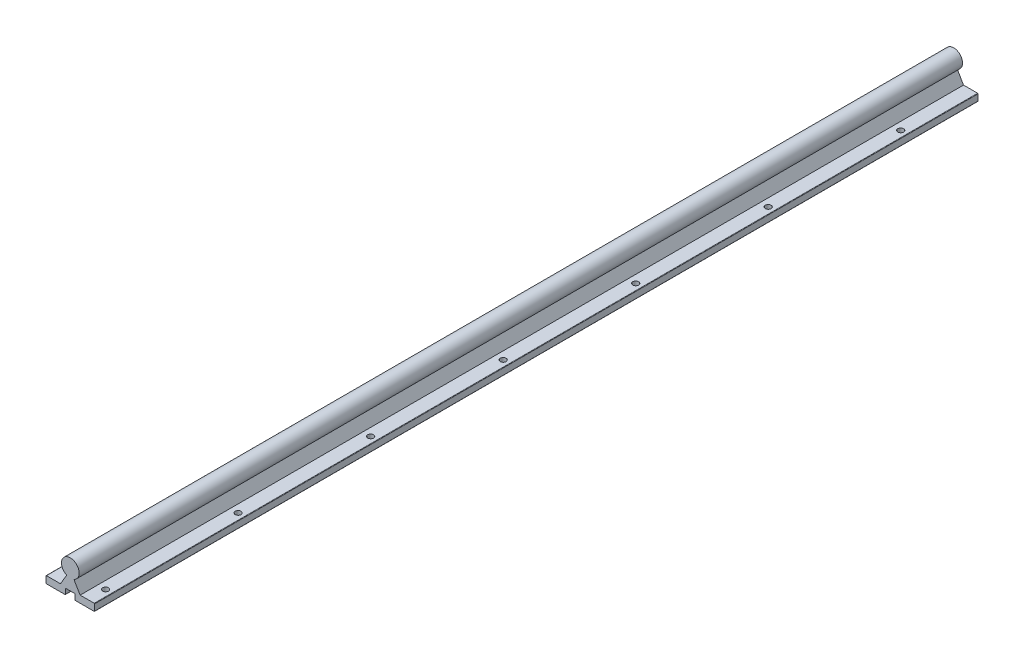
ISO-10303-21;
HEADER;
FILE_DESCRIPTION(('STEP AP214'),'2;1');
FILE_NAME('part.step','',(''),(''),'','','');
FILE_SCHEMA(('AUTOMOTIVE_DESIGN { 1 0 10303 214 1 1 1 1 }'));
ENDSEC;
DATA;
#1=APPLICATION_CONTEXT('core data for automotive mechanical design processes');
#2=APPLICATION_PROTOCOL_DEFINITION('international standard','automotive_design',2000,#1);
#3=PRODUCT_CONTEXT('',#1,'mechanical');
#4=PRODUCT('Part','Part','',(#3));
#5=PRODUCT_RELATED_PRODUCT_CATEGORY('part','',(#4));
#6=PRODUCT_DEFINITION_FORMATION('','',#4);
#7=PRODUCT_DEFINITION_CONTEXT('part definition',#1,'design');
#8=PRODUCT_DEFINITION('design','',#6,#7);
#9=PRODUCT_DEFINITION_SHAPE('','',#8);
#10=(LENGTH_UNIT() NAMED_UNIT(*) SI_UNIT(.MILLI.,.METRE.));
#11=(NAMED_UNIT(*) PLANE_ANGLE_UNIT() SI_UNIT($,.RADIAN.));
#12=(NAMED_UNIT(*) SI_UNIT($,.STERADIAN.) SOLID_ANGLE_UNIT());
#13=UNCERTAINTY_MEASURE_WITH_UNIT(LENGTH_MEASURE(1.E-05),#10,'distance_accuracy_value','');
#14=(GEOMETRIC_REPRESENTATION_CONTEXT(3) GLOBAL_UNCERTAINTY_ASSIGNED_CONTEXT((#13)) GLOBAL_UNIT_ASSIGNED_CONTEXT((#10,
#11,#12)) REPRESENTATION_CONTEXT('',''));
#15=CARTESIAN_POINT('',(0.,0.,0.));
#16=DIRECTION('',(0.,0.,1.));
#17=DIRECTION('',(1.,0.,0.));
#18=AXIS2_PLACEMENT_3D('',#15,#16,#17);
#19=CARTESIAN_POINT('',(-27.,4.,1000.));
#20=DIRECTION('',(0.,-1.,0.));
#21=DIRECTION('',(0.,0.,-1.));
#22=AXIS2_PLACEMENT_3D('',#19,#20,#21);
#23=PLANE('',#22);
#24=CARTESIAN_POINT('',(-20.,4.,80.000000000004));
#25=DIRECTION('',(0.,1.,0.));
#26=DIRECTION('',(0.,0.,1.));
#27=AXIS2_PLACEMENT_3D('',#24,#25,#26);
#28=CIRCLE('',#27,3.3);
#29=CARTESIAN_POINT('',(-20.,4.,83.3000000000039));
#30=VERTEX_POINT('',#29);
#31=EDGE_CURVE('E1045',#30,#30,#28,.T.);
#32=ORIENTED_EDGE('',*,*,#31,.F.);
#33=EDGE_LOOP('',(#32));
#34=FACE_BOUND('',#33,.T.);
#35=CARTESIAN_POINT('',(-20.,4.,380.000000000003));
#36=DIRECTION('',(0.,1.,0.));
#37=DIRECTION('',(0.,0.,1.));
#38=AXIS2_PLACEMENT_3D('',#35,#36,#37);
#39=CIRCLE('',#38,3.3);
#40=CARTESIAN_POINT('',(-20.,4.,383.300000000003));
#41=VERTEX_POINT('',#40);
#42=EDGE_CURVE('E1059',#41,#41,#39,.T.);
#43=ORIENTED_EDGE('',*,*,#42,.F.);
#44=EDGE_LOOP('',(#43));
#45=FACE_BOUND('',#44,.T.);
#46=CARTESIAN_POINT('',(-20.,4.,530.000000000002));
#47=DIRECTION('',(0.,1.,0.));
#48=DIRECTION('',(0.,0.,1.));
#49=AXIS2_PLACEMENT_3D('',#46,#47,#48);
#50=CIRCLE('',#49,3.3);
#51=CARTESIAN_POINT('',(-20.,4.,533.300000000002));
#52=VERTEX_POINT('',#51);
#53=EDGE_CURVE('E1067',#52,#52,#50,.T.);
#54=ORIENTED_EDGE('',*,*,#53,.F.);
#55=EDGE_LOOP('',(#54));
#56=FACE_BOUND('',#55,.T.);
#57=CARTESIAN_POINT('',(-20.,4.,680.000000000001));
#58=DIRECTION('',(0.,1.,0.));
#59=DIRECTION('',(0.,0.,1.));
#60=AXIS2_PLACEMENT_3D('',#57,#58,#59);
#61=CIRCLE('',#60,3.3);
#62=CARTESIAN_POINT('',(-20.,4.,683.300000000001));
#63=VERTEX_POINT('',#62);
#64=EDGE_CURVE('E1075',#63,#63,#61,.T.);
#65=ORIENTED_EDGE('',*,*,#64,.F.);
#66=EDGE_LOOP('',(#65));
#67=FACE_BOUND('',#66,.T.);
#68=CARTESIAN_POINT('',(-20.,4.,830.000000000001));
#69=DIRECTION('',(0.,1.,0.));
#70=DIRECTION('',(0.,0.,1.));
#71=AXIS2_PLACEMENT_3D('',#68,#69,#70);
#72=CIRCLE('',#71,3.3);
#73=CARTESIAN_POINT('',(-20.,4.,833.300000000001));
#74=VERTEX_POINT('',#73);
#75=EDGE_CURVE('E1083',#74,#74,#72,.T.);
#76=ORIENTED_EDGE('',*,*,#75,.F.);
#77=EDGE_LOOP('',(#76));
#78=FACE_BOUND('',#77,.T.);
#79=CARTESIAN_POINT('',(-20.,4.,980.));
#80=DIRECTION('',(0.,1.,0.));
#81=DIRECTION('',(0.,0.,1.));
#82=AXIS2_PLACEMENT_3D('',#79,#80,#81);
#83=CIRCLE('',#82,3.3);
#84=CARTESIAN_POINT('',(-20.,4.,983.3));
#85=VERTEX_POINT('',#84);
#86=EDGE_CURVE('E1139',#85,#85,#83,.T.);
#87=ORIENTED_EDGE('',*,*,#86,.F.);
#88=EDGE_LOOP('',(#87));
#89=FACE_BOUND('',#88,.T.);
#90=DIRECTION('',(-1.,0.,0.));
#91=VECTOR('',#90,1.);
#92=CARTESIAN_POINT('',(-27.,4.,0.));
#93=LINE('',#92,#91);
#94=CARTESIAN_POINT('',(-11.151813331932,4.,0.));
#95=VERTEX_POINT('',#94);
#96=CARTESIAN_POINT('',(-27.,4.,0.));
#97=VERTEX_POINT('',#96);
#98=EDGE_CURVE('E280',#95,#97,#93,.T.);
#99=ORIENTED_EDGE('',*,*,#98,.T.);
#100=DIRECTION('',(0.,0.,-1.));
#101=VECTOR('',#100,1.);
#102=CARTESIAN_POINT('',(-27.,4.,1000.));
#103=LINE('',#102,#101);
#104=CARTESIAN_POINT('',(-27.,4.,1000.));
#105=VERTEX_POINT('',#104);
#106=EDGE_CURVE('E390',#105,#97,#103,.T.);
#107=ORIENTED_EDGE('',*,*,#106,.F.);
#108=DIRECTION('',(-1.,0.,0.));
#109=VECTOR('',#108,1.);
#110=CARTESIAN_POINT('',(-27.,4.,1000.));
#111=LINE('',#110,#109);
#112=CARTESIAN_POINT('',(-11.151813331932,4.,1000.));
#113=VERTEX_POINT('',#112);
#114=EDGE_CURVE('E439',#113,#105,#111,.T.);
#115=ORIENTED_EDGE('',*,*,#114,.F.);
#116=DIRECTION('',(0.,0.,-1.));
#117=VECTOR('',#116,1.);
#118=CARTESIAN_POINT('',(-11.151813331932,4.,1000.));
#119=LINE('',#118,#117);
#120=EDGE_CURVE('E394',#113,#95,#119,.T.);
#121=ORIENTED_EDGE('',*,*,#120,.T.);
#122=EDGE_LOOP('',(#99,#107,#115,#121));
#123=FACE_BOUND('',#122,.T.);
#124=CARTESIAN_POINT('',(-20.,4.,230.000000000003));
#125=DIRECTION('',(0.,1.,0.));
#126=DIRECTION('',(0.,0.,1.));
#127=AXIS2_PLACEMENT_3D('',#124,#125,#126);
#128=CIRCLE('',#127,3.3);
#129=CARTESIAN_POINT('',(-20.,4.,233.300000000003));
#130=VERTEX_POINT('',#129);
#131=EDGE_CURVE('E1049',#130,#130,#128,.T.);
#132=ORIENTED_EDGE('',*,*,#131,.F.);
#133=EDGE_LOOP('',(#132));
#134=FACE_BOUND('',#133,.T.);
#135=ADVANCED_FACE('F61',(#34,#45,#56,#67,#78,#89,#123,#134),#23,.F.);
#136=CARTESIAN_POINT('',(11.151813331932,4.,1000.));
#137=DIRECTION('',(0.,-1.,0.));
#138=DIRECTION('',(0.,0.,-1.));
#139=AXIS2_PLACEMENT_3D('',#136,#137,#138);
#140=PLANE('',#139);
#141=CARTESIAN_POINT('',(20.,4.,80.000000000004));
#142=DIRECTION('',(0.,1.,0.));
#143=DIRECTION('',(0.,0.,1.));
#144=AXIS2_PLACEMENT_3D('',#141,#142,#143);
#145=CIRCLE('',#144,3.3);
#146=CARTESIAN_POINT('',(20.,4.,83.3000000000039));
#147=VERTEX_POINT('',#146);
#148=EDGE_CURVE('E1091',#147,#147,#145,.T.);
#149=ORIENTED_EDGE('',*,*,#148,.F.);
#150=EDGE_LOOP('',(#149));
#151=FACE_BOUND('',#150,.T.);
#152=CARTESIAN_POINT('',(20.,4.,230.000000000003));
#153=DIRECTION('',(0.,1.,0.));
#154=DIRECTION('',(0.,0.,1.));
#155=AXIS2_PLACEMENT_3D('',#152,#153,#154);
#156=CIRCLE('',#155,3.3);
#157=CARTESIAN_POINT('',(20.,4.,233.300000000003));
#158=VERTEX_POINT('',#157);
#159=EDGE_CURVE('E1099',#158,#158,#156,.T.);
#160=ORIENTED_EDGE('',*,*,#159,.F.);
#161=EDGE_LOOP('',(#160));
#162=FACE_BOUND('',#161,.T.);
#163=CARTESIAN_POINT('',(20.,4.,380.000000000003));
#164=DIRECTION('',(0.,1.,0.));
#165=DIRECTION('',(0.,0.,1.));
#166=AXIS2_PLACEMENT_3D('',#163,#164,#165);
#167=CIRCLE('',#166,3.3);
#168=CARTESIAN_POINT('',(20.,4.,383.300000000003));
#169=VERTEX_POINT('',#168);
#170=EDGE_CURVE('E1107',#169,#169,#167,.T.);
#171=ORIENTED_EDGE('',*,*,#170,.F.);
#172=EDGE_LOOP('',(#171));
#173=FACE_BOUND('',#172,.T.);
#174=CARTESIAN_POINT('',(20.,4.,680.000000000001));
#175=DIRECTION('',(0.,1.,0.));
#176=DIRECTION('',(0.,0.,1.));
#177=AXIS2_PLACEMENT_3D('',#174,#175,#176);
#178=CIRCLE('',#177,3.3);
#179=CARTESIAN_POINT('',(20.,4.,683.300000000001));
#180=VERTEX_POINT('',#179);
#181=EDGE_CURVE('E1123',#180,#180,#178,.T.);
#182=ORIENTED_EDGE('',*,*,#181,.F.);
#183=EDGE_LOOP('',(#182));
#184=FACE_BOUND('',#183,.T.);
#185=CARTESIAN_POINT('',(20.,4.,830.000000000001));
#186=DIRECTION('',(0.,1.,0.));
#187=DIRECTION('',(0.,0.,1.));
#188=AXIS2_PLACEMENT_3D('',#185,#186,#187);
#189=CIRCLE('',#188,3.3);
#190=CARTESIAN_POINT('',(20.,4.,833.300000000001));
#191=VERTEX_POINT('',#190);
#192=EDGE_CURVE('E1131',#191,#191,#189,.T.);
#193=ORIENTED_EDGE('',*,*,#192,.F.);
#194=EDGE_LOOP('',(#193));
#195=FACE_BOUND('',#194,.T.);
#196=CARTESIAN_POINT('',(20.,4.,980.));
#197=DIRECTION('',(0.,1.,0.));
#198=DIRECTION('',(0.,0.,1.));
#199=AXIS2_PLACEMENT_3D('',#196,#197,#198);
#200=CIRCLE('',#199,3.3);
#201=CARTESIAN_POINT('',(20.,4.,983.3));
#202=VERTEX_POINT('',#201);
#203=EDGE_CURVE('E1147',#202,#202,#200,.T.);
#204=ORIENTED_EDGE('',*,*,#203,.F.);
#205=EDGE_LOOP('',(#204));
#206=FACE_BOUND('',#205,.T.);
#207=DIRECTION('',(-1.,0.,0.));
#208=VECTOR('',#207,1.);
#209=CARTESIAN_POINT('',(11.151813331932,4.,0.));
#210=LINE('',#209,#208);
#211=CARTESIAN_POINT('',(27.,4.,0.));
#212=VERTEX_POINT('',#211);
#213=CARTESIAN_POINT('',(11.151813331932,4.,0.));
#214=VERTEX_POINT('',#213);
#215=EDGE_CURVE('E156',#212,#214,#210,.T.);
#216=ORIENTED_EDGE('',*,*,#215,.T.);
#217=DIRECTION('',(0.,0.,-1.));
#218=VECTOR('',#217,1.);
#219=CARTESIAN_POINT('',(11.151813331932,4.,1000.));
#220=LINE('',#219,#218);
#221=CARTESIAN_POINT('',(11.151813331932,4.,1000.));
#222=VERTEX_POINT('',#221);
#223=EDGE_CURVE('E249',#222,#214,#220,.T.);
#224=ORIENTED_EDGE('',*,*,#223,.F.);
#225=DIRECTION('',(-1.,0.,0.));
#226=VECTOR('',#225,1.);
#227=CARTESIAN_POINT('',(11.151813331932,4.,1000.));
#228=LINE('',#227,#226);
#229=CARTESIAN_POINT('',(27.,4.,1000.));
#230=VERTEX_POINT('',#229);
#231=EDGE_CURVE('E235',#230,#222,#228,.T.);
#232=ORIENTED_EDGE('',*,*,#231,.F.);
#233=DIRECTION('',(0.,0.,-1.));
#234=VECTOR('',#233,1.);
#235=CARTESIAN_POINT('',(27.,4.,1000.));
#236=LINE('',#235,#234);
#237=EDGE_CURVE('E243',#230,#212,#236,.T.);
#238=ORIENTED_EDGE('',*,*,#237,.T.);
#239=EDGE_LOOP('',(#216,#224,#232,#238));
#240=FACE_BOUND('',#239,.T.);
#241=CARTESIAN_POINT('',(20.,4.,530.000000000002));
#242=DIRECTION('',(0.,1.,0.));
#243=DIRECTION('',(0.,0.,1.));
#244=AXIS2_PLACEMENT_3D('',#241,#242,#243);
#245=CIRCLE('',#244,3.3);
#246=CARTESIAN_POINT('',(20.,4.,533.300000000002));
#247=VERTEX_POINT('',#246);
#248=EDGE_CURVE('E1115',#247,#247,#245,.T.);
#249=ORIENTED_EDGE('',*,*,#248,.F.);
#250=EDGE_LOOP('',(#249));
#251=FACE_BOUND('',#250,.T.);
#252=ADVANCED_FACE('F251',(#151,#162,#173,#184,#195,#206,#240,#251),#140,.F.);
#253=CARTESIAN_POINT('',(3.96518292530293,15.14,1000.));
#254=DIRECTION('',(0.,0.,-1.));
#255=DIRECTION('',(-1.,0.,0.));
#256=AXIS2_PLACEMENT_3D('',#253,#254,#255);
#257=CYLINDRICAL_SURFACE('',#256,0.5);
#258=CARTESIAN_POINT('',(3.96518292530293,15.14,0.));
#259=DIRECTION('',(0.,0.,1.));
#260=DIRECTION('',(1.,0.,0.));
#261=AXIS2_PLACEMENT_3D('',#258,#259,#260);
#262=CIRCLE('',#261,0.5);
#263=CARTESIAN_POINT('',(4.39526328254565,15.3950115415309,0.));
#264=VERTEX_POINT('',#263);
#265=CARTESIAN_POINT('',(3.96518292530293,15.64,0.));
#266=VERTEX_POINT('',#265);
#267=EDGE_CURVE('E260',#264,#266,#262,.T.);
#268=ORIENTED_EDGE('',*,*,#267,.T.);
#269=DIRECTION('',(0.,0.,-1.));
#270=VECTOR('',#269,1.);
#271=CARTESIAN_POINT('',(3.96518292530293,15.64,1000.));
#272=LINE('',#271,#270);
#273=CARTESIAN_POINT('',(3.96518292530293,15.64,1000.));
#274=VERTEX_POINT('',#273);
#275=EDGE_CURVE('E12',#274,#266,#272,.T.);
#276=ORIENTED_EDGE('',*,*,#275,.F.);
#277=CARTESIAN_POINT('',(3.96518292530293,15.14,1000.));
#278=DIRECTION('',(0.,0.,1.));
#279=DIRECTION('',(1.,0.,0.));
#280=AXIS2_PLACEMENT_3D('',#277,#278,#279);
#281=CIRCLE('',#280,0.5);
#282=CARTESIAN_POINT('',(4.39526328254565,15.3950115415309,1000.));
#283=VERTEX_POINT('',#282);
#284=EDGE_CURVE('E331',#283,#274,#281,.T.);
#285=ORIENTED_EDGE('',*,*,#284,.F.);
#286=DIRECTION('',(0.,0.,-1.));
#287=VECTOR('',#286,1.);
#288=CARTESIAN_POINT('',(4.39526328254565,15.3950115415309,1000.));
#289=LINE('',#288,#287);
#290=EDGE_CURVE('E256',#283,#264,#289,.T.);
#291=ORIENTED_EDGE('',*,*,#290,.T.);
#292=EDGE_LOOP('',(#268,#276,#285,#291));
#293=FACE_BOUND('',#292,.T.);
#294=ADVANCED_FACE('F63',(#293),#257,.T.);
#295=CARTESIAN_POINT('',(3.52000000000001,15.64,1000.));
#296=DIRECTION('',(0.,-1.,0.));
#297=DIRECTION('',(0.,0.,-1.));
#298=AXIS2_PLACEMENT_3D('',#295,#296,#297);
#299=PLANE('',#298);
#300=DIRECTION('',(-1.,0.,0.));
#301=VECTOR('',#300,1.);
#302=CARTESIAN_POINT('',(3.52000000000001,15.64,0.));
#303=LINE('',#302,#301);
#304=CARTESIAN_POINT('',(3.52,15.64,0.));
#305=VERTEX_POINT('',#304);
#306=EDGE_CURVE('E264',#266,#305,#303,.T.);
#307=ORIENTED_EDGE('',*,*,#306,.T.);
#308=DIRECTION('',(0.,0.,-1.));
#309=VECTOR('',#308,1.);
#310=CARTESIAN_POINT('',(3.52,15.64,1000.));
#311=LINE('',#310,#309);
#312=CARTESIAN_POINT('',(3.52,15.64,1000.));
#313=VERTEX_POINT('',#312);
#314=EDGE_CURVE('E71',#313,#305,#311,.T.);
#315=ORIENTED_EDGE('',*,*,#314,.F.);
#316=DIRECTION('',(-1.,0.,0.));
#317=VECTOR('',#316,1.);
#318=CARTESIAN_POINT('',(3.52000000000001,15.64,1000.));
#319=LINE('',#318,#317);
#320=EDGE_CURVE('E170',#274,#313,#319,.T.);
#321=ORIENTED_EDGE('',*,*,#320,.F.);
#322=ORIENTED_EDGE('',*,*,#275,.T.);
#323=EDGE_LOOP('',(#307,#315,#321,#322));
#324=FACE_BOUND('',#323,.T.);
#325=ADVANCED_FACE('F531',(#324),#299,.F.);
#326=CARTESIAN_POINT('',(0.,25.,1000.));
#327=DIRECTION('',(0.,0.,-1.));
#328=DIRECTION('',(-1.,0.,0.));
#329=AXIS2_PLACEMENT_3D('',#326,#327,#328);
#330=CYLINDRICAL_SURFACE('',#329,10.);
#331=CARTESIAN_POINT('',(0.,25.,0.));
#332=DIRECTION('',(0.,0.,1.));
#333=DIRECTION('',(1.,0.,0.));
#334=AXIS2_PLACEMENT_3D('',#331,#332,#333);
#335=CIRCLE('',#334,10.);
#336=CARTESIAN_POINT('',(-3.52000000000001,15.64,0.));
#337=VERTEX_POINT('',#336);
#338=EDGE_CURVE('E268',#305,#337,#335,.T.);
#339=ORIENTED_EDGE('',*,*,#338,.T.);
#340=DIRECTION('',(0.,0.,-1.));
#341=VECTOR('',#340,1.);
#342=CARTESIAN_POINT('',(-3.52000000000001,15.64,1000.));
#343=LINE('',#342,#341);
#344=CARTESIAN_POINT('',(-3.52000000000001,15.64,1000.));
#345=VERTEX_POINT('',#344);
#346=EDGE_CURVE('E406',#345,#337,#343,.T.);
#347=ORIENTED_EDGE('',*,*,#346,.F.);
#348=CARTESIAN_POINT('',(0.,25.,1000.));
#349=DIRECTION('',(0.,0.,1.));
#350=DIRECTION('',(1.,0.,0.));
#351=AXIS2_PLACEMENT_3D('',#348,#349,#350);
#352=CIRCLE('',#351,10.);
#353=EDGE_CURVE('E416',#313,#345,#352,.T.);
#354=ORIENTED_EDGE('',*,*,#353,.F.);
#355=ORIENTED_EDGE('',*,*,#314,.T.);
#356=EDGE_LOOP('',(#339,#347,#354,#355));
#357=FACE_BOUND('',#356,.T.);
#358=ADVANCED_FACE('F414',(#357),#330,.T.);
#359=CARTESIAN_POINT('',(-3.96518292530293,15.64,1000.));
#360=DIRECTION('',(0.,-1.,0.));
#361=DIRECTION('',(0.,0.,-1.));
#362=AXIS2_PLACEMENT_3D('',#359,#360,#361);
#363=PLANE('',#362);
#364=DIRECTION('',(-1.,0.,0.));
#365=VECTOR('',#364,1.);
#366=CARTESIAN_POINT('',(-3.96518292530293,15.64,0.));
#367=LINE('',#366,#365);
#368=CARTESIAN_POINT('',(-3.96518292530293,15.64,0.));
#369=VERTEX_POINT('',#368);
#370=EDGE_CURVE('E271',#337,#369,#367,.T.);
#371=ORIENTED_EDGE('',*,*,#370,.T.);
#372=DIRECTION('',(0.,0.,-1.));
#373=VECTOR('',#372,1.);
#374=CARTESIAN_POINT('',(-3.96518292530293,15.64,1000.));
#375=LINE('',#374,#373);
#376=CARTESIAN_POINT('',(-3.96518292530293,15.64,1000.));
#377=VERTEX_POINT('',#376);
#378=EDGE_CURVE('E402',#377,#369,#375,.T.);
#379=ORIENTED_EDGE('',*,*,#378,.F.);
#380=DIRECTION('',(-1.,0.,0.));
#381=VECTOR('',#380,1.);
#382=CARTESIAN_POINT('',(-3.96518292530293,15.64,1000.));
#383=LINE('',#382,#381);
#384=EDGE_CURVE('E435',#345,#377,#383,.T.);
#385=ORIENTED_EDGE('',*,*,#384,.F.);
#386=ORIENTED_EDGE('',*,*,#346,.T.);
#387=EDGE_LOOP('',(#371,#379,#385,#386));
#388=FACE_BOUND('',#387,.T.);
#389=ADVANCED_FACE('F425',(#388),#363,.F.);
#390=CARTESIAN_POINT('',(-3.96518292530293,15.14,1000.));
#391=DIRECTION('',(0.,0.,-1.));
#392=DIRECTION('',(-1.,0.,0.));
#393=AXIS2_PLACEMENT_3D('',#390,#391,#392);
#394=CYLINDRICAL_SURFACE('',#393,0.5);
#395=CARTESIAN_POINT('',(-3.96518292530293,15.14,0.));
#396=DIRECTION('',(0.,0.,1.));
#397=DIRECTION('',(-1.,0.,0.));
#398=AXIS2_PLACEMENT_3D('',#395,#396,#397);
#399=CIRCLE('',#398,0.5);
#400=CARTESIAN_POINT('',(-4.39526328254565,15.3950115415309,0.));
#401=VERTEX_POINT('',#400);
#402=EDGE_CURVE('E274',#369,#401,#399,.T.);
#403=ORIENTED_EDGE('',*,*,#402,.T.);
#404=DIRECTION('',(0.,0.,-1.));
#405=VECTOR('',#404,1.);
#406=CARTESIAN_POINT('',(-4.39526328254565,15.3950115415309,1000.));
#407=LINE('',#406,#405);
#408=CARTESIAN_POINT('',(-4.39526328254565,15.3950115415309,1000.));
#409=VERTEX_POINT('',#408);
#410=EDGE_CURVE('E398',#409,#401,#407,.T.);
#411=ORIENTED_EDGE('',*,*,#410,.F.);
#412=CARTESIAN_POINT('',(-3.96518292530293,15.14,1000.));
#413=DIRECTION('',(0.,0.,1.));
#414=DIRECTION('',(-1.,0.,0.));
#415=AXIS2_PLACEMENT_3D('',#412,#413,#414);
#416=CIRCLE('',#415,0.5);
#417=EDGE_CURVE('E431',#377,#409,#416,.T.);
#418=ORIENTED_EDGE('',*,*,#417,.F.);
#419=ORIENTED_EDGE('',*,*,#378,.T.);
#420=EDGE_LOOP('',(#403,#411,#418,#419));
#421=FACE_BOUND('',#420,.T.);
#422=ADVANCED_FACE('F429',(#421),#394,.T.);
#423=CARTESIAN_POINT('',(-11.151813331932,4.,1000.));
#424=DIRECTION('',(0.86016071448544,-0.510023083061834,0.));
#425=DIRECTION('',(0.510023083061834,0.86016071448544,0.));
#426=AXIS2_PLACEMENT_3D('',#423,#424,#425);
#427=PLANE('',#426);
#428=DIRECTION('',(-0.510023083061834,-0.86016071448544,0.));
#429=VECTOR('',#428,1.);
#430=CARTESIAN_POINT('',(-11.151813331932,4.,0.));
#431=LINE('',#430,#429);
#432=EDGE_CURVE('E277',#401,#95,#431,.T.);
#433=ORIENTED_EDGE('',*,*,#432,.T.);
#434=ORIENTED_EDGE('',*,*,#120,.F.);
#435=DIRECTION('',(-0.510023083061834,-0.86016071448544,0.));
#436=VECTOR('',#435,1.);
#437=CARTESIAN_POINT('',(-11.151813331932,4.,1000.));
#438=LINE('',#437,#436);
#439=EDGE_CURVE('E434',#409,#113,#438,.T.);
#440=ORIENTED_EDGE('',*,*,#439,.F.);
#441=ORIENTED_EDGE('',*,*,#410,.T.);
#442=EDGE_LOOP('',(#433,#434,#440,#441));
#443=FACE_BOUND('',#442,.T.);
#444=ADVANCED_FACE('F522',(#443),#427,.F.);
#445=CARTESIAN_POINT('',(-27.,3.5,1000.));
#446=DIRECTION('',(0.,0.,-1.));
#447=DIRECTION('',(-1.,0.,0.));
#448=AXIS2_PLACEMENT_3D('',#445,#446,#447);
#449=CYLINDRICAL_SURFACE('',#448,0.5);
#450=CARTESIAN_POINT('',(-27.,3.5,0.));
#451=DIRECTION('',(0.,0.,1.));
#452=DIRECTION('',(1.,0.,0.));
#453=AXIS2_PLACEMENT_3D('',#450,#451,#452);
#454=CIRCLE('',#453,0.5);
#455=CARTESIAN_POINT('',(-27.5,3.5,0.));
#456=VERTEX_POINT('',#455);
#457=EDGE_CURVE('E283',#97,#456,#454,.T.);
#458=ORIENTED_EDGE('',*,*,#457,.T.);
#459=DIRECTION('',(0.,0.,-1.));
#460=VECTOR('',#459,1.);
#461=CARTESIAN_POINT('',(-27.5,3.5,1000.));
#462=LINE('',#461,#460);
#463=CARTESIAN_POINT('',(-27.5,3.5,1000.));
#464=VERTEX_POINT('',#463);
#465=EDGE_CURVE('E386',#464,#456,#462,.T.);
#466=ORIENTED_EDGE('',*,*,#465,.F.);
#467=CARTESIAN_POINT('',(-27.,3.5,1000.));
#468=DIRECTION('',(0.,0.,1.));
#469=DIRECTION('',(1.,0.,0.));
#470=AXIS2_PLACEMENT_3D('',#467,#468,#469);
#471=CIRCLE('',#470,0.5);
#472=EDGE_CURVE('E446',#105,#464,#471,.T.);
#473=ORIENTED_EDGE('',*,*,#472,.F.);
#474=ORIENTED_EDGE('',*,*,#106,.T.);
#475=EDGE_LOOP('',(#458,#466,#473,#474));
#476=FACE_BOUND('',#475,.T.);
#477=ADVANCED_FACE('F520',(#476),#449,.T.);
#478=CARTESIAN_POINT('',(-27.5,3.5,1000.));
#479=DIRECTION('',(1.,0.,0.));
#480=DIRECTION('',(0.,0.,-1.));
#481=AXIS2_PLACEMENT_3D('',#478,#479,#480);
#482=PLANE('',#481);
#483=DIRECTION('',(0.,-1.,0.));
#484=VECTOR('',#483,1.);
#485=CARTESIAN_POINT('',(-27.5,3.5,0.));
#486=LINE('',#485,#484);
#487=CARTESIAN_POINT('',(-27.5,-3.5,0.));
#488=VERTEX_POINT('',#487);
#489=EDGE_CURVE('E286',#456,#488,#486,.T.);
#490=ORIENTED_EDGE('',*,*,#489,.T.);
#491=DIRECTION('',(0.,0.,-1.));
#492=VECTOR('',#491,1.);
#493=CARTESIAN_POINT('',(-27.5,-3.5,1000.));
#494=LINE('',#493,#492);
#495=CARTESIAN_POINT('',(-27.5,-3.5,1000.));
#496=VERTEX_POINT('',#495);
#497=EDGE_CURVE('E382',#496,#488,#494,.T.);
#498=ORIENTED_EDGE('',*,*,#497,.F.);
#499=DIRECTION('',(0.,-1.,0.));
#500=VECTOR('',#499,1.);
#501=CARTESIAN_POINT('',(-27.5,3.5,1000.));
#502=LINE('',#501,#500);
#503=EDGE_CURVE('E449',#464,#496,#502,.T.);
#504=ORIENTED_EDGE('',*,*,#503,.F.);
#505=ORIENTED_EDGE('',*,*,#465,.T.);
#506=EDGE_LOOP('',(#490,#498,#504,#505));
#507=FACE_BOUND('',#506,.T.);
#508=ADVANCED_FACE('F733',(#507),#482,.F.);
#509=CARTESIAN_POINT('',(-27.,-3.5,1000.));
#510=DIRECTION('',(0.,0.,-1.));
#511=DIRECTION('',(-1.,0.,0.));
#512=AXIS2_PLACEMENT_3D('',#509,#510,#511);
#513=CYLINDRICAL_SURFACE('',#512,0.5);
#514=CARTESIAN_POINT('',(-27.,-3.5,0.));
#515=DIRECTION('',(0.,0.,1.));
#516=DIRECTION('',(1.,0.,0.));
#517=AXIS2_PLACEMENT_3D('',#514,#515,#516);
#518=CIRCLE('',#517,0.5);
#519=CARTESIAN_POINT('',(-27.,-4.,0.));
#520=VERTEX_POINT('',#519);
#521=EDGE_CURVE('E289',#488,#520,#518,.T.);
#522=ORIENTED_EDGE('',*,*,#521,.T.);
#523=DIRECTION('',(0.,0.,-1.));
#524=VECTOR('',#523,1.);
#525=CARTESIAN_POINT('',(-27.,-4.,1000.));
#526=LINE('',#525,#524);
#527=CARTESIAN_POINT('',(-27.,-4.,1000.));
#528=VERTEX_POINT('',#527);
#529=EDGE_CURVE('E378',#528,#520,#526,.T.);
#530=ORIENTED_EDGE('',*,*,#529,.F.);
#531=CARTESIAN_POINT('',(-27.,-3.5,1000.));
#532=DIRECTION('',(0.,0.,1.));
#533=DIRECTION('',(1.,0.,0.));
#534=AXIS2_PLACEMENT_3D('',#531,#532,#533);
#535=CIRCLE('',#534,0.5);
#536=EDGE_CURVE('E452',#496,#528,#535,.T.);
#537=ORIENTED_EDGE('',*,*,#536,.F.);
#538=ORIENTED_EDGE('',*,*,#497,.T.);
#539=EDGE_LOOP('',(#522,#530,#537,#538));
#540=FACE_BOUND('',#539,.T.);
#541=ADVANCED_FACE('F727',(#540),#513,.T.);
#542=CARTESIAN_POINT('',(-27.,-4.,1000.));
#543=DIRECTION('',(0.,1.,0.));
#544=DIRECTION('',(0.,0.,1.));
#545=AXIS2_PLACEMENT_3D('',#542,#543,#544);
#546=PLANE('',#545);
#547=CARTESIAN_POINT('',(-20.,-4.,80.000000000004));
#548=DIRECTION('',(0.,1.,0.));
#549=DIRECTION('',(0.,0.,1.));
#550=AXIS2_PLACEMENT_3D('',#547,#548,#549);
#551=CIRCLE('',#550,3.3);
#552=CARTESIAN_POINT('',(-20.,-4.,83.3000000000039));
#553=VERTEX_POINT('',#552);
#554=EDGE_CURVE('E1043',#553,#553,#551,.T.);
#555=ORIENTED_EDGE('',*,*,#554,.T.);
#556=EDGE_LOOP('',(#555));
#557=FACE_BOUND('',#556,.T.);
#558=CARTESIAN_POINT('',(-20.,-4.,230.000000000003));
#559=DIRECTION('',(0.,1.,0.));
#560=DIRECTION('',(0.,0.,1.));
#561=AXIS2_PLACEMENT_3D('',#558,#559,#560);
#562=CIRCLE('',#561,3.3);
#563=CARTESIAN_POINT('',(-20.,-4.,233.300000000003));
#564=VERTEX_POINT('',#563);
#565=EDGE_CURVE('E1055',#564,#564,#562,.T.);
#566=ORIENTED_EDGE('',*,*,#565,.T.);
#567=EDGE_LOOP('',(#566));
#568=FACE_BOUND('',#567,.T.);
#569=CARTESIAN_POINT('',(-20.,-4.,380.000000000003));
#570=DIRECTION('',(0.,1.,0.));
#571=DIRECTION('',(0.,0.,1.));
#572=AXIS2_PLACEMENT_3D('',#569,#570,#571);
#573=CIRCLE('',#572,3.3);
#574=CARTESIAN_POINT('',(-20.,-4.,383.300000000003));
#575=VERTEX_POINT('',#574);
#576=EDGE_CURVE('E1063',#575,#575,#573,.T.);
#577=ORIENTED_EDGE('',*,*,#576,.T.);
#578=EDGE_LOOP('',(#577));
#579=FACE_BOUND('',#578,.T.);
#580=CARTESIAN_POINT('',(-20.,-4.,530.000000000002));
#581=DIRECTION('',(0.,1.,0.));
#582=DIRECTION('',(0.,0.,1.));
#583=AXIS2_PLACEMENT_3D('',#580,#581,#582);
#584=CIRCLE('',#583,3.3);
#585=CARTESIAN_POINT('',(-20.,-4.,533.300000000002));
#586=VERTEX_POINT('',#585);
#587=EDGE_CURVE('E1071',#586,#586,#584,.T.);
#588=ORIENTED_EDGE('',*,*,#587,.T.);
#589=EDGE_LOOP('',(#588));
#590=FACE_BOUND('',#589,.T.);
#591=CARTESIAN_POINT('',(-20.,-4.,680.000000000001));
#592=DIRECTION('',(0.,1.,0.));
#593=DIRECTION('',(0.,0.,1.));
#594=AXIS2_PLACEMENT_3D('',#591,#592,#593);
#595=CIRCLE('',#594,3.3);
#596=CARTESIAN_POINT('',(-20.,-4.,683.300000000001));
#597=VERTEX_POINT('',#596);
#598=EDGE_CURVE('E1079',#597,#597,#595,.T.);
#599=ORIENTED_EDGE('',*,*,#598,.T.);
#600=EDGE_LOOP('',(#599));
#601=FACE_BOUND('',#600,.T.);
#602=CARTESIAN_POINT('',(-20.,-4.,830.000000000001));
#603=DIRECTION('',(0.,1.,0.));
#604=DIRECTION('',(0.,0.,1.));
#605=AXIS2_PLACEMENT_3D('',#602,#603,#604);
#606=CIRCLE('',#605,3.3);
#607=CARTESIAN_POINT('',(-20.,-4.,833.300000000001));
#608=VERTEX_POINT('',#607);
#609=EDGE_CURVE('E1087',#608,#608,#606,.T.);
#610=ORIENTED_EDGE('',*,*,#609,.T.);
#611=EDGE_LOOP('',(#610));
#612=FACE_BOUND('',#611,.T.);
#613=CARTESIAN_POINT('',(-20.,-4.,980.));
#614=DIRECTION('',(0.,1.,0.));
#615=DIRECTION('',(0.,0.,1.));
#616=AXIS2_PLACEMENT_3D('',#613,#614,#615);
#617=CIRCLE('',#616,3.3);
#618=CARTESIAN_POINT('',(-20.,-4.,983.3));
#619=VERTEX_POINT('',#618);
#620=EDGE_CURVE('E1143',#619,#619,#617,.T.);
#621=ORIENTED_EDGE('',*,*,#620,.T.);
#622=EDGE_LOOP('',(#621));
#623=FACE_BOUND('',#622,.T.);
#624=DIRECTION('',(1.,0.,0.));
#625=VECTOR('',#624,1.);
#626=CARTESIAN_POINT('',(-27.,-4.,0.));
#627=LINE('',#626,#625);
#628=CARTESIAN_POINT('',(-6.00000000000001,-4.,0.));
#629=VERTEX_POINT('',#628);
#630=EDGE_CURVE('E292',#520,#629,#627,.T.);
#631=ORIENTED_EDGE('',*,*,#630,.T.);
#632=DIRECTION('',(0.,0.,-1.));
#633=VECTOR('',#632,1.);
#634=CARTESIAN_POINT('',(-6.00000000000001,-4.,1000.));
#635=LINE('',#634,#633);
#636=CARTESIAN_POINT('',(-6.00000000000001,-4.,1000.));
#637=VERTEX_POINT('',#636);
#638=EDGE_CURVE('E374',#637,#629,#635,.T.);
#639=ORIENTED_EDGE('',*,*,#638,.F.);
#640=DIRECTION('',(1.,0.,0.));
#641=VECTOR('',#640,1.);
#642=CARTESIAN_POINT('',(-27.,-4.,1000.));
#643=LINE('',#642,#641);
#644=EDGE_CURVE('E455',#528,#637,#643,.T.);
#645=ORIENTED_EDGE('',*,*,#644,.F.);
#646=ORIENTED_EDGE('',*,*,#529,.T.);
#647=EDGE_LOOP('',(#631,#639,#645,#646));
#648=FACE_BOUND('',#647,.T.);
#649=ADVANCED_FACE('F718',(#557,#568,#579,#590,#601,#612,#623,#648),#546,.F.);
#650=CARTESIAN_POINT('',(-6.,-3.5,1000.));
#651=DIRECTION('',(0.,0.,-1.));
#652=DIRECTION('',(-1.,0.,0.));
#653=AXIS2_PLACEMENT_3D('',#650,#651,#652);
#654=CYLINDRICAL_SURFACE('',#653,0.5);
#655=CARTESIAN_POINT('',(-6.,-3.5,0.));
#656=DIRECTION('',(0.,0.,1.));
#657=DIRECTION('',(-1.,0.,0.));
#658=AXIS2_PLACEMENT_3D('',#655,#656,#657);
#659=CIRCLE('',#658,0.5);
#660=CARTESIAN_POINT('',(-5.5,-3.5,0.));
#661=VERTEX_POINT('',#660);
#662=EDGE_CURVE('E295',#629,#661,#659,.T.);
#663=ORIENTED_EDGE('',*,*,#662,.T.);
#664=DIRECTION('',(0.,0.,-1.));
#665=VECTOR('',#664,1.);
#666=CARTESIAN_POINT('',(-5.5,-3.5,1000.));
#667=LINE('',#666,#665);
#668=CARTESIAN_POINT('',(-5.5,-3.5,1000.));
#669=VERTEX_POINT('',#668);
#670=EDGE_CURVE('E370',#669,#661,#667,.T.);
#671=ORIENTED_EDGE('',*,*,#670,.F.);
#672=CARTESIAN_POINT('',(-6.,-3.5,1000.));
#673=DIRECTION('',(0.,0.,1.));
#674=DIRECTION('',(-1.,0.,0.));
#675=AXIS2_PLACEMENT_3D('',#672,#673,#674);
#676=CIRCLE('',#675,0.5);
#677=EDGE_CURVE('E458',#637,#669,#676,.T.);
#678=ORIENTED_EDGE('',*,*,#677,.F.);
#679=ORIENTED_EDGE('',*,*,#638,.T.);
#680=EDGE_LOOP('',(#663,#671,#678,#679));
#681=FACE_BOUND('',#680,.T.);
#682=ADVANCED_FACE('F706',(#681),#654,.T.);
#683=CARTESIAN_POINT('',(-5.50000000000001,2.,1000.));
#684=DIRECTION('',(-1.,0.,0.));
#685=DIRECTION('',(0.,-1.,0.));
#686=AXIS2_PLACEMENT_3D('',#683,#684,#685);
#687=PLANE('',#686);
#688=DIRECTION('',(0.,1.,0.));
#689=VECTOR('',#688,1.);
#690=CARTESIAN_POINT('',(-5.50000000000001,2.,0.));
#691=LINE('',#690,#689);
#692=CARTESIAN_POINT('',(-5.50000000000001,2.,0.));
#693=VERTEX_POINT('',#692);
#694=EDGE_CURVE('E298',#661,#693,#691,.T.);
#695=ORIENTED_EDGE('',*,*,#694,.T.);
#696=DIRECTION('',(0.,0.,-1.));
#697=VECTOR('',#696,1.);
#698=CARTESIAN_POINT('',(-5.50000000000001,2.,1000.));
#699=LINE('',#698,#697);
#700=CARTESIAN_POINT('',(-5.50000000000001,2.,1000.));
#701=VERTEX_POINT('',#700);
#702=EDGE_CURVE('E366',#701,#693,#699,.T.);
#703=ORIENTED_EDGE('',*,*,#702,.F.);
#704=DIRECTION('',(0.,1.,0.));
#705=VECTOR('',#704,1.);
#706=CARTESIAN_POINT('',(-5.50000000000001,2.,1000.));
#707=LINE('',#706,#705);
#708=EDGE_CURVE('E461',#669,#701,#707,.T.);
#709=ORIENTED_EDGE('',*,*,#708,.F.);
#710=ORIENTED_EDGE('',*,*,#670,.T.);
#711=EDGE_LOOP('',(#695,#703,#709,#710));
#712=FACE_BOUND('',#711,.T.);
#713=ADVANCED_FACE('F694',(#712),#687,.F.);
#714=CARTESIAN_POINT('',(-5.00000000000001,2.,1000.));
#715=DIRECTION('',(0.,0.,-1.));
#716=DIRECTION('',(-1.,0.,0.));
#717=AXIS2_PLACEMENT_3D('',#714,#715,#716);
#718=CYLINDRICAL_SURFACE('',#717,0.5);
#719=CARTESIAN_POINT('',(-5.00000000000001,2.,0.));
#720=DIRECTION('',(0.,0.,-1.));
#721=DIRECTION('',(1.,0.,0.));
#722=AXIS2_PLACEMENT_3D('',#719,#720,#721);
#723=CIRCLE('',#722,0.5);
#724=CARTESIAN_POINT('',(-5.,2.5,0.));
#725=VERTEX_POINT('',#724);
#726=EDGE_CURVE('E301',#693,#725,#723,.T.);
#727=ORIENTED_EDGE('',*,*,#726,.T.);
#728=DIRECTION('',(0.,0.,-1.));
#729=VECTOR('',#728,1.);
#730=CARTESIAN_POINT('',(-5.,2.5,1000.));
#731=LINE('',#730,#729);
#732=CARTESIAN_POINT('',(-5.,2.5,1000.));
#733=VERTEX_POINT('',#732);
#734=EDGE_CURVE('E362',#733,#725,#731,.T.);
#735=ORIENTED_EDGE('',*,*,#734,.F.);
#736=CARTESIAN_POINT('',(-5.00000000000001,2.,1000.));
#737=DIRECTION('',(0.,0.,-1.));
#738=DIRECTION('',(1.,0.,0.));
#739=AXIS2_PLACEMENT_3D('',#736,#737,#738);
#740=CIRCLE('',#739,0.5);
#741=EDGE_CURVE('E464',#701,#733,#740,.T.);
#742=ORIENTED_EDGE('',*,*,#741,.F.);
#743=ORIENTED_EDGE('',*,*,#702,.T.);
#744=EDGE_LOOP('',(#727,#735,#742,#743));
#745=FACE_BOUND('',#744,.T.);
#746=ADVANCED_FACE('F682',(#745),#718,.F.);
#747=CARTESIAN_POINT('',(-5.,2.5,1000.));
#748=DIRECTION('',(0.,1.,0.));
#749=DIRECTION('',(0.,0.,1.));
#750=AXIS2_PLACEMENT_3D('',#747,#748,#749);
#751=PLANE('',#750);
#752=DIRECTION('',(1.,0.,0.));
#753=VECTOR('',#752,1.);
#754=CARTESIAN_POINT('',(-5.,2.5,0.));
#755=LINE('',#754,#753);
#756=CARTESIAN_POINT('',(4.99999999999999,2.5,0.));
#757=VERTEX_POINT('',#756);
#758=EDGE_CURVE('E304',#725,#757,#755,.T.);
#759=ORIENTED_EDGE('',*,*,#758,.T.);
#760=DIRECTION('',(0.,0.,-1.));
#761=VECTOR('',#760,1.);
#762=CARTESIAN_POINT('',(4.99999999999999,2.5,1000.));
#763=LINE('',#762,#761);
#764=CARTESIAN_POINT('',(4.99999999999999,2.5,1000.));
#765=VERTEX_POINT('',#764);
#766=EDGE_CURVE('E358',#765,#757,#763,.T.);
#767=ORIENTED_EDGE('',*,*,#766,.F.);
#768=DIRECTION('',(1.,0.,0.));
#769=VECTOR('',#768,1.);
#770=CARTESIAN_POINT('',(-5.,2.5,1000.));
#771=LINE('',#770,#769);
#772=EDGE_CURVE('E467',#733,#765,#771,.T.);
#773=ORIENTED_EDGE('',*,*,#772,.F.);
#774=ORIENTED_EDGE('',*,*,#734,.T.);
#775=EDGE_LOOP('',(#759,#767,#773,#774));
#776=FACE_BOUND('',#775,.T.);
#777=ADVANCED_FACE('F670',(#776),#751,.F.);
#778=CARTESIAN_POINT('',(4.99999999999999,2.,1000.));
#779=DIRECTION('',(0.,0.,-1.));
#780=DIRECTION('',(-1.,0.,0.));
#781=AXIS2_PLACEMENT_3D('',#778,#779,#780);
#782=CYLINDRICAL_SURFACE('',#781,0.5);
#783=CARTESIAN_POINT('',(4.99999999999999,2.,0.));
#784=DIRECTION('',(0.,0.,-1.));
#785=DIRECTION('',(-1.,0.,0.));
#786=AXIS2_PLACEMENT_3D('',#783,#784,#785);
#787=CIRCLE('',#786,0.5);
#788=CARTESIAN_POINT('',(5.49999999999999,2.,0.));
#789=VERTEX_POINT('',#788);
#790=EDGE_CURVE('E307',#757,#789,#787,.T.);
#791=ORIENTED_EDGE('',*,*,#790,.T.);
#792=DIRECTION('',(0.,0.,-1.));
#793=VECTOR('',#792,1.);
#794=CARTESIAN_POINT('',(5.49999999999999,2.,1000.));
#795=LINE('',#794,#793);
#796=CARTESIAN_POINT('',(5.49999999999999,2.,1000.));
#797=VERTEX_POINT('',#796);
#798=EDGE_CURVE('E354',#797,#789,#795,.T.);
#799=ORIENTED_EDGE('',*,*,#798,.F.);
#800=CARTESIAN_POINT('',(4.99999999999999,2.,1000.));
#801=DIRECTION('',(0.,0.,-1.));
#802=DIRECTION('',(-1.,0.,0.));
#803=AXIS2_PLACEMENT_3D('',#800,#801,#802);
#804=CIRCLE('',#803,0.5);
#805=EDGE_CURVE('E470',#765,#797,#804,.T.);
#806=ORIENTED_EDGE('',*,*,#805,.F.);
#807=ORIENTED_EDGE('',*,*,#766,.T.);
#808=EDGE_LOOP('',(#791,#799,#806,#807));
#809=FACE_BOUND('',#808,.T.);
#810=ADVANCED_FACE('F658',(#809),#782,.F.);
#811=CARTESIAN_POINT('',(5.49999999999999,2.,1000.));
#812=DIRECTION('',(1.,0.,0.));
#813=DIRECTION('',(0.,1.,0.));
#814=AXIS2_PLACEMENT_3D('',#811,#812,#813);
#815=PLANE('',#814);
#816=DIRECTION('',(0.,-1.,0.));
#817=VECTOR('',#816,1.);
#818=CARTESIAN_POINT('',(5.49999999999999,2.,0.));
#819=LINE('',#818,#817);
#820=CARTESIAN_POINT('',(5.5,-3.5,0.));
#821=VERTEX_POINT('',#820);
#822=EDGE_CURVE('E310',#789,#821,#819,.T.);
#823=ORIENTED_EDGE('',*,*,#822,.T.);
#824=DIRECTION('',(0.,0.,-1.));
#825=VECTOR('',#824,1.);
#826=CARTESIAN_POINT('',(5.5,-3.5,1000.));
#827=LINE('',#826,#825);
#828=CARTESIAN_POINT('',(5.5,-3.5,1000.));
#829=VERTEX_POINT('',#828);
#830=EDGE_CURVE('E350',#829,#821,#827,.T.);
#831=ORIENTED_EDGE('',*,*,#830,.F.);
#832=DIRECTION('',(0.,-1.,0.));
#833=VECTOR('',#832,1.);
#834=CARTESIAN_POINT('',(5.49999999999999,2.,1000.));
#835=LINE('',#834,#833);
#836=EDGE_CURVE('E473',#797,#829,#835,.T.);
#837=ORIENTED_EDGE('',*,*,#836,.F.);
#838=ORIENTED_EDGE('',*,*,#798,.T.);
#839=EDGE_LOOP('',(#823,#831,#837,#838));
#840=FACE_BOUND('',#839,.T.);
#841=ADVANCED_FACE('F646',(#840),#815,.F.);
#842=CARTESIAN_POINT('',(6.,-3.5,1000.));
#843=DIRECTION('',(0.,0.,-1.));
#844=DIRECTION('',(-1.,0.,0.));
#845=AXIS2_PLACEMENT_3D('',#842,#843,#844);
#846=CYLINDRICAL_SURFACE('',#845,0.5);
#847=CARTESIAN_POINT('',(6.,-3.5,0.));
#848=DIRECTION('',(0.,0.,1.));
#849=DIRECTION('',(-1.,0.,0.));
#850=AXIS2_PLACEMENT_3D('',#847,#848,#849);
#851=CIRCLE('',#850,0.5);
#852=CARTESIAN_POINT('',(6.,-4.,0.));
#853=VERTEX_POINT('',#852);
#854=EDGE_CURVE('E313',#821,#853,#851,.T.);
#855=ORIENTED_EDGE('',*,*,#854,.T.);
#856=DIRECTION('',(0.,0.,-1.));
#857=VECTOR('',#856,1.);
#858=CARTESIAN_POINT('',(6.,-4.,1000.));
#859=LINE('',#858,#857);
#860=CARTESIAN_POINT('',(6.,-4.,1000.));
#861=VERTEX_POINT('',#860);
#862=EDGE_CURVE('E346',#861,#853,#859,.T.);
#863=ORIENTED_EDGE('',*,*,#862,.F.);
#864=CARTESIAN_POINT('',(6.,-3.5,1000.));
#865=DIRECTION('',(0.,0.,1.));
#866=DIRECTION('',(-1.,0.,0.));
#867=AXIS2_PLACEMENT_3D('',#864,#865,#866);
#868=CIRCLE('',#867,0.5);
#869=EDGE_CURVE('E476',#829,#861,#868,.T.);
#870=ORIENTED_EDGE('',*,*,#869,.F.);
#871=ORIENTED_EDGE('',*,*,#830,.T.);
#872=EDGE_LOOP('',(#855,#863,#870,#871));
#873=FACE_BOUND('',#872,.T.);
#874=ADVANCED_FACE('F640',(#873),#846,.T.);
#875=CARTESIAN_POINT('',(6.,-4.,1000.));
#876=DIRECTION('',(0.,1.,0.));
#877=DIRECTION('',(0.,0.,1.));
#878=AXIS2_PLACEMENT_3D('',#875,#876,#877);
#879=PLANE('',#878);
#880=CARTESIAN_POINT('',(20.,-4.,80.000000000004));
#881=DIRECTION('',(0.,1.,0.));
#882=DIRECTION('',(0.,0.,1.));
#883=AXIS2_PLACEMENT_3D('',#880,#881,#882);
#884=CIRCLE('',#883,3.3);
#885=CARTESIAN_POINT('',(20.,-4.,83.3000000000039));
#886=VERTEX_POINT('',#885);
#887=EDGE_CURVE('E1095',#886,#886,#884,.T.);
#888=ORIENTED_EDGE('',*,*,#887,.T.);
#889=EDGE_LOOP('',(#888));
#890=FACE_BOUND('',#889,.T.);
#891=CARTESIAN_POINT('',(20.,-4.,230.000000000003));
#892=DIRECTION('',(0.,1.,0.));
#893=DIRECTION('',(0.,0.,1.));
#894=AXIS2_PLACEMENT_3D('',#891,#892,#893);
#895=CIRCLE('',#894,3.3);
#896=CARTESIAN_POINT('',(20.,-4.,233.300000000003));
#897=VERTEX_POINT('',#896);
#898=EDGE_CURVE('E1103',#897,#897,#895,.T.);
#899=ORIENTED_EDGE('',*,*,#898,.T.);
#900=EDGE_LOOP('',(#899));
#901=FACE_BOUND('',#900,.T.);
#902=CARTESIAN_POINT('',(20.,-4.,380.000000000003));
#903=DIRECTION('',(0.,1.,0.));
#904=DIRECTION('',(0.,0.,1.));
#905=AXIS2_PLACEMENT_3D('',#902,#903,#904);
#906=CIRCLE('',#905,3.3);
#907=CARTESIAN_POINT('',(20.,-4.,383.300000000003));
#908=VERTEX_POINT('',#907);
#909=EDGE_CURVE('E1111',#908,#908,#906,.T.);
#910=ORIENTED_EDGE('',*,*,#909,.T.);
#911=EDGE_LOOP('',(#910));
#912=FACE_BOUND('',#911,.T.);
#913=CARTESIAN_POINT('',(20.,-4.,530.000000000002));
#914=DIRECTION('',(0.,1.,0.));
#915=DIRECTION('',(0.,0.,1.));
#916=AXIS2_PLACEMENT_3D('',#913,#914,#915);
#917=CIRCLE('',#916,3.3);
#918=CARTESIAN_POINT('',(20.,-4.,533.300000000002));
#919=VERTEX_POINT('',#918);
#920=EDGE_CURVE('E1119',#919,#919,#917,.T.);
#921=ORIENTED_EDGE('',*,*,#920,.T.);
#922=EDGE_LOOP('',(#921));
#923=FACE_BOUND('',#922,.T.);
#924=CARTESIAN_POINT('',(20.,-4.,680.000000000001));
#925=DIRECTION('',(0.,1.,0.));
#926=DIRECTION('',(0.,0.,1.));
#927=AXIS2_PLACEMENT_3D('',#924,#925,#926);
#928=CIRCLE('',#927,3.3);
#929=CARTESIAN_POINT('',(20.,-4.,683.300000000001));
#930=VERTEX_POINT('',#929);
#931=EDGE_CURVE('E1127',#930,#930,#928,.T.);
#932=ORIENTED_EDGE('',*,*,#931,.T.);
#933=EDGE_LOOP('',(#932));
#934=FACE_BOUND('',#933,.T.);
#935=CARTESIAN_POINT('',(20.,-4.,830.000000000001));
#936=DIRECTION('',(0.,1.,0.));
#937=DIRECTION('',(0.,0.,1.));
#938=AXIS2_PLACEMENT_3D('',#935,#936,#937);
#939=CIRCLE('',#938,3.3);
#940=CARTESIAN_POINT('',(20.,-4.,833.300000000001));
#941=VERTEX_POINT('',#940);
#942=EDGE_CURVE('E1135',#941,#941,#939,.T.);
#943=ORIENTED_EDGE('',*,*,#942,.T.);
#944=EDGE_LOOP('',(#943));
#945=FACE_BOUND('',#944,.T.);
#946=CARTESIAN_POINT('',(20.,-4.,980.));
#947=DIRECTION('',(0.,1.,0.));
#948=DIRECTION('',(0.,0.,1.));
#949=AXIS2_PLACEMENT_3D('',#946,#947,#948);
#950=CIRCLE('',#949,3.3);
#951=CARTESIAN_POINT('',(20.,-4.,983.3));
#952=VERTEX_POINT('',#951);
#953=EDGE_CURVE('E265',#952,#952,#950,.T.);
#954=ORIENTED_EDGE('',*,*,#953,.T.);
#955=EDGE_LOOP('',(#954));
#956=FACE_BOUND('',#955,.T.);
#957=DIRECTION('',(1.,0.,0.));
#958=VECTOR('',#957,1.);
#959=CARTESIAN_POINT('',(6.,-4.,0.));
#960=LINE('',#959,#958);
#961=CARTESIAN_POINT('',(27.,-4.,0.));
#962=VERTEX_POINT('',#961);
#963=EDGE_CURVE('E316',#853,#962,#960,.T.);
#964=ORIENTED_EDGE('',*,*,#963,.T.);
#965=DIRECTION('',(0.,0.,-1.));
#966=VECTOR('',#965,1.);
#967=CARTESIAN_POINT('',(27.,-4.,1000.));
#968=LINE('',#967,#966);
#969=CARTESIAN_POINT('',(27.,-4.,1000.));
#970=VERTEX_POINT('',#969);
#971=EDGE_CURVE('E342',#970,#962,#968,.T.);
#972=ORIENTED_EDGE('',*,*,#971,.F.);
#973=DIRECTION('',(1.,0.,0.));
#974=VECTOR('',#973,1.);
#975=CARTESIAN_POINT('',(6.,-4.,1000.));
#976=LINE('',#975,#974);
#977=EDGE_CURVE('E479',#861,#970,#976,.T.);
#978=ORIENTED_EDGE('',*,*,#977,.F.);
#979=ORIENTED_EDGE('',*,*,#862,.T.);
#980=EDGE_LOOP('',(#964,#972,#978,#979));
#981=FACE_BOUND('',#980,.T.);
#982=ADVANCED_FACE('F632',(#890,#901,#912,#923,#934,#945,#956,#981),#879,.F.);
#983=CARTESIAN_POINT('',(27.,-3.5,1000.));
#984=DIRECTION('',(0.,0.,-1.));
#985=DIRECTION('',(-1.,0.,0.));
#986=AXIS2_PLACEMENT_3D('',#983,#984,#985);
#987=CYLINDRICAL_SURFACE('',#986,0.5);
#988=CARTESIAN_POINT('',(27.,-3.5,0.));
#989=DIRECTION('',(0.,0.,1.));
#990=DIRECTION('',(1.,0.,0.));
#991=AXIS2_PLACEMENT_3D('',#988,#989,#990);
#992=CIRCLE('',#991,0.5);
#993=CARTESIAN_POINT('',(27.5,-3.5,0.));
#994=VERTEX_POINT('',#993);
#995=EDGE_CURVE('E319',#962,#994,#992,.T.);
#996=ORIENTED_EDGE('',*,*,#995,.T.);
#997=DIRECTION('',(0.,0.,-1.));
#998=VECTOR('',#997,1.);
#999=CARTESIAN_POINT('',(27.5,-3.5,1000.));
#1000=LINE('',#999,#998);
#1001=CARTESIAN_POINT('',(27.5,-3.5,1000.));
#1002=VERTEX_POINT('',#1001);
#1003=EDGE_CURVE('E338',#1002,#994,#1000,.T.);
#1004=ORIENTED_EDGE('',*,*,#1003,.F.);
#1005=CARTESIAN_POINT('',(27.,-3.5,1000.));
#1006=DIRECTION('',(0.,0.,1.));
#1007=DIRECTION('',(1.,0.,0.));
#1008=AXIS2_PLACEMENT_3D('',#1005,#1006,#1007);
#1009=CIRCLE('',#1008,0.5);
#1010=EDGE_CURVE('E482',#970,#1002,#1009,.T.);
#1011=ORIENTED_EDGE('',*,*,#1010,.F.);
#1012=ORIENTED_EDGE('',*,*,#971,.T.);
#1013=EDGE_LOOP('',(#996,#1004,#1011,#1012));
#1014=FACE_BOUND('',#1013,.T.);
#1015=ADVANCED_FACE('F490',(#1014),#987,.T.);
#1016=CARTESIAN_POINT('',(27.5,3.5,1000.));
#1017=DIRECTION('',(-1.,0.,0.));
#1018=DIRECTION('',(0.,0.,1.));
#1019=AXIS2_PLACEMENT_3D('',#1016,#1017,#1018);
#1020=PLANE('',#1019);
#1021=DIRECTION('',(0.,1.,0.));
#1022=VECTOR('',#1021,1.);
#1023=CARTESIAN_POINT('',(27.5,3.5,0.));
#1024=LINE('',#1023,#1022);
#1025=CARTESIAN_POINT('',(27.5,3.5,0.));
#1026=VERTEX_POINT('',#1025);
#1027=EDGE_CURVE('E322',#994,#1026,#1024,.T.);
#1028=ORIENTED_EDGE('',*,*,#1027,.T.);
#1029=DIRECTION('',(0.,0.,-1.));
#1030=VECTOR('',#1029,1.);
#1031=CARTESIAN_POINT('',(27.5,3.5,1000.));
#1032=LINE('',#1031,#1030);
#1033=CARTESIAN_POINT('',(27.5,3.5,1000.));
#1034=VERTEX_POINT('',#1033);
#1035=EDGE_CURVE('E248',#1034,#1026,#1032,.T.);
#1036=ORIENTED_EDGE('',*,*,#1035,.F.);
#1037=DIRECTION('',(0.,1.,0.));
#1038=VECTOR('',#1037,1.);
#1039=CARTESIAN_POINT('',(27.5,3.5,1000.));
#1040=LINE('',#1039,#1038);
#1041=EDGE_CURVE('E237',#1002,#1034,#1040,.T.);
#1042=ORIENTED_EDGE('',*,*,#1041,.F.);
#1043=ORIENTED_EDGE('',*,*,#1003,.T.);
#1044=EDGE_LOOP('',(#1028,#1036,#1042,#1043));
#1045=FACE_BOUND('',#1044,.T.);
#1046=ADVANCED_FACE('F494',(#1045),#1020,.F.);
#1047=CARTESIAN_POINT('',(27.,3.5,1000.));
#1048=DIRECTION('',(0.,0.,-1.));
#1049=DIRECTION('',(-1.,0.,0.));
#1050=AXIS2_PLACEMENT_3D('',#1047,#1048,#1049);
#1051=CYLINDRICAL_SURFACE('',#1050,0.5);
#1052=CARTESIAN_POINT('',(27.,3.5,0.));
#1053=DIRECTION('',(0.,0.,1.));
#1054=DIRECTION('',(-1.,0.,0.));
#1055=AXIS2_PLACEMENT_3D('',#1052,#1053,#1054);
#1056=CIRCLE('',#1055,0.5);
#1057=EDGE_CURVE('E246',#1026,#212,#1056,.T.);
#1058=ORIENTED_EDGE('',*,*,#1057,.T.);
#1059=ORIENTED_EDGE('',*,*,#237,.F.);
#1060=CARTESIAN_POINT('',(27.,3.5,1000.));
#1061=DIRECTION('',(0.,0.,1.));
#1062=DIRECTION('',(-1.,0.,0.));
#1063=AXIS2_PLACEMENT_3D('',#1060,#1061,#1062);
#1064=CIRCLE('',#1063,0.5);
#1065=EDGE_CURVE('E231',#1034,#230,#1064,.T.);
#1066=ORIENTED_EDGE('',*,*,#1065,.F.);
#1067=ORIENTED_EDGE('',*,*,#1035,.T.);
#1068=EDGE_LOOP('',(#1058,#1059,#1066,#1067));
#1069=FACE_BOUND('',#1068,.T.);
#1070=ADVANCED_FACE('F244',(#1069),#1051,.T.);
#1071=CARTESIAN_POINT('',(11.151813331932,4.,1000.));
#1072=DIRECTION('',(-0.86016071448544,-0.510023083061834,0.));
#1073=DIRECTION('',(0.510023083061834,-0.86016071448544,0.));
#1074=AXIS2_PLACEMENT_3D('',#1071,#1072,#1073);
#1075=PLANE('',#1074);
#1076=DIRECTION('',(-0.510023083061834,0.86016071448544,0.));
#1077=VECTOR('',#1076,1.);
#1078=CARTESIAN_POINT('',(11.151813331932,4.,0.));
#1079=LINE('',#1078,#1077);
#1080=EDGE_CURVE('E162',#214,#264,#1079,.T.);
#1081=ORIENTED_EDGE('',*,*,#1080,.T.);
#1082=ORIENTED_EDGE('',*,*,#290,.F.);
#1083=DIRECTION('',(-0.510023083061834,0.86016071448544,0.));
#1084=VECTOR('',#1083,1.);
#1085=CARTESIAN_POINT('',(11.151813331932,4.,1000.));
#1086=LINE('',#1085,#1084);
#1087=EDGE_CURVE('E79',#222,#283,#1086,.T.);
#1088=ORIENTED_EDGE('',*,*,#1087,.F.);
#1089=ORIENTED_EDGE('',*,*,#223,.T.);
#1090=EDGE_LOOP('',(#1081,#1082,#1088,#1089));
#1091=FACE_BOUND('',#1090,.T.);
#1092=ADVANCED_FACE('F498',(#1091),#1075,.F.);
#1093=CARTESIAN_POINT('',(3.96518292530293,15.14,1000.));
#1094=DIRECTION('',(0.,0.,1.));
#1095=DIRECTION('',(1.,0.,0.));
#1096=AXIS2_PLACEMENT_3D('',#1093,#1094,#1095);
#1097=PLANE('',#1096);
#1098=ORIENTED_EDGE('',*,*,#284,.T.);
#1099=ORIENTED_EDGE('',*,*,#320,.T.);
#1100=ORIENTED_EDGE('',*,*,#353,.T.);
#1101=ORIENTED_EDGE('',*,*,#384,.T.);
#1102=ORIENTED_EDGE('',*,*,#417,.T.);
#1103=ORIENTED_EDGE('',*,*,#439,.T.);
#1104=ORIENTED_EDGE('',*,*,#114,.T.);
#1105=ORIENTED_EDGE('',*,*,#472,.T.);
#1106=ORIENTED_EDGE('',*,*,#503,.T.);
#1107=ORIENTED_EDGE('',*,*,#536,.T.);
#1108=ORIENTED_EDGE('',*,*,#644,.T.);
#1109=ORIENTED_EDGE('',*,*,#677,.T.);
#1110=ORIENTED_EDGE('',*,*,#708,.T.);
#1111=ORIENTED_EDGE('',*,*,#741,.T.);
#1112=ORIENTED_EDGE('',*,*,#772,.T.);
#1113=ORIENTED_EDGE('',*,*,#805,.T.);
#1114=ORIENTED_EDGE('',*,*,#836,.T.);
#1115=ORIENTED_EDGE('',*,*,#869,.T.);
#1116=ORIENTED_EDGE('',*,*,#977,.T.);
#1117=ORIENTED_EDGE('',*,*,#1010,.T.);
#1118=ORIENTED_EDGE('',*,*,#1041,.T.);
#1119=ORIENTED_EDGE('',*,*,#1065,.T.);
#1120=ORIENTED_EDGE('',*,*,#231,.T.);
#1121=ORIENTED_EDGE('',*,*,#1087,.T.);
#1122=EDGE_LOOP('',(#1098,#1099,#1100,#1101,#1102,#1103,#1104,#1105,#1106,#1107,#1108,#1109,
#1110,#1111,#1112,#1113,#1114,#1115,#1116,#1117,#1118,#1119,#1120,#1121));
#1123=FACE_BOUND('',#1122,.T.);
#1124=ADVANCED_FACE('F233',(#1123),#1097,.T.);
#1125=CARTESIAN_POINT('',(3.96518292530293,15.14,0.));
#1126=DIRECTION('',(0.,0.,1.));
#1127=DIRECTION('',(1.,0.,0.));
#1128=AXIS2_PLACEMENT_3D('',#1125,#1126,#1127);
#1129=PLANE('',#1128);
#1130=ORIENTED_EDGE('',*,*,#267,.F.);
#1131=ORIENTED_EDGE('',*,*,#1080,.F.);
#1132=ORIENTED_EDGE('',*,*,#215,.F.);
#1133=ORIENTED_EDGE('',*,*,#1057,.F.);
#1134=ORIENTED_EDGE('',*,*,#1027,.F.);
#1135=ORIENTED_EDGE('',*,*,#995,.F.);
#1136=ORIENTED_EDGE('',*,*,#963,.F.);
#1137=ORIENTED_EDGE('',*,*,#854,.F.);
#1138=ORIENTED_EDGE('',*,*,#822,.F.);
#1139=ORIENTED_EDGE('',*,*,#790,.F.);
#1140=ORIENTED_EDGE('',*,*,#758,.F.);
#1141=ORIENTED_EDGE('',*,*,#726,.F.);
#1142=ORIENTED_EDGE('',*,*,#694,.F.);
#1143=ORIENTED_EDGE('',*,*,#662,.F.);
#1144=ORIENTED_EDGE('',*,*,#630,.F.);
#1145=ORIENTED_EDGE('',*,*,#521,.F.);
#1146=ORIENTED_EDGE('',*,*,#489,.F.);
#1147=ORIENTED_EDGE('',*,*,#457,.F.);
#1148=ORIENTED_EDGE('',*,*,#98,.F.);
#1149=ORIENTED_EDGE('',*,*,#432,.F.);
#1150=ORIENTED_EDGE('',*,*,#402,.F.);
#1151=ORIENTED_EDGE('',*,*,#370,.F.);
#1152=ORIENTED_EDGE('',*,*,#338,.F.);
#1153=ORIENTED_EDGE('',*,*,#306,.F.);
#1154=EDGE_LOOP('',(#1130,#1131,#1132,#1133,#1134,#1135,#1136,#1137,#1138,#1139,#1140,#1141,
#1142,#1143,#1144,#1145,#1146,#1147,#1148,#1149,#1150,#1151,#1152,#1153));
#1155=FACE_BOUND('',#1154,.T.);
#1156=ADVANCED_FACE('F420',(#1155),#1129,.F.);
#1157=CARTESIAN_POINT('',(20.,4.,980.));
#1158=DIRECTION('',(0.,1.,0.));
#1159=DIRECTION('',(0.,0.,1.));
#1160=AXIS2_PLACEMENT_3D('',#1157,#1158,#1159);
#1161=CYLINDRICAL_SURFACE('',#1160,3.3);
#1162=ORIENTED_EDGE('',*,*,#953,.F.);
#1163=EDGE_LOOP('',(#1162));
#1164=FACE_BOUND('',#1163,.T.);
#1165=ORIENTED_EDGE('',*,*,#203,.T.);
#1166=EDGE_LOOP('',(#1165));
#1167=FACE_BOUND('',#1166,.T.);
#1168=ADVANCED_FACE('F563',(#1164,#1167),#1161,.F.);
#1169=CARTESIAN_POINT('',(-20.,4.,980.));
#1170=DIRECTION('',(0.,1.,0.));
#1171=DIRECTION('',(0.,0.,1.));
#1172=AXIS2_PLACEMENT_3D('',#1169,#1170,#1171);
#1173=CYLINDRICAL_SURFACE('',#1172,3.3);
#1174=ORIENTED_EDGE('',*,*,#620,.F.);
#1175=EDGE_LOOP('',(#1174));
#1176=FACE_BOUND('',#1175,.T.);
#1177=ORIENTED_EDGE('',*,*,#86,.T.);
#1178=EDGE_LOOP('',(#1177));
#1179=FACE_BOUND('',#1178,.T.);
#1180=ADVANCED_FACE('F556',(#1176,#1179),#1173,.F.);
#1181=CARTESIAN_POINT('',(20.,4.,830.000000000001));
#1182=DIRECTION('',(0.,1.,0.));
#1183=DIRECTION('',(0.,0.,1.));
#1184=AXIS2_PLACEMENT_3D('',#1181,#1182,#1183);
#1185=CYLINDRICAL_SURFACE('',#1184,3.3);
#1186=ORIENTED_EDGE('',*,*,#942,.F.);
#1187=EDGE_LOOP('',(#1186));
#1188=FACE_BOUND('',#1187,.T.);
#1189=ORIENTED_EDGE('',*,*,#192,.T.);
#1190=EDGE_LOOP('',(#1189));
#1191=FACE_BOUND('',#1190,.T.);
#1192=ADVANCED_FACE('F562',(#1188,#1191),#1185,.F.);
#1193=CARTESIAN_POINT('',(20.,4.,680.000000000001));
#1194=DIRECTION('',(0.,1.,0.));
#1195=DIRECTION('',(0.,0.,1.));
#1196=AXIS2_PLACEMENT_3D('',#1193,#1194,#1195);
#1197=CYLINDRICAL_SURFACE('',#1196,3.3);
#1198=ORIENTED_EDGE('',*,*,#931,.F.);
#1199=EDGE_LOOP('',(#1198));
#1200=FACE_BOUND('',#1199,.T.);
#1201=ORIENTED_EDGE('',*,*,#181,.T.);
#1202=EDGE_LOOP('',(#1201));
#1203=FACE_BOUND('',#1202,.T.);
#1204=ADVANCED_FACE('F850',(#1200,#1203),#1197,.F.);
#1205=CARTESIAN_POINT('',(20.,4.,530.000000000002));
#1206=DIRECTION('',(0.,1.,0.));
#1207=DIRECTION('',(0.,0.,1.));
#1208=AXIS2_PLACEMENT_3D('',#1205,#1206,#1207);
#1209=CYLINDRICAL_SURFACE('',#1208,3.3);
#1210=ORIENTED_EDGE('',*,*,#920,.F.);
#1211=EDGE_LOOP('',(#1210));
#1212=FACE_BOUND('',#1211,.T.);
#1213=ORIENTED_EDGE('',*,*,#248,.T.);
#1214=EDGE_LOOP('',(#1213));
#1215=FACE_BOUND('',#1214,.T.);
#1216=ADVANCED_FACE('F860',(#1212,#1215),#1209,.F.);
#1217=CARTESIAN_POINT('',(20.,4.,380.000000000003));
#1218=DIRECTION('',(0.,1.,0.));
#1219=DIRECTION('',(0.,0.,1.));
#1220=AXIS2_PLACEMENT_3D('',#1217,#1218,#1219);
#1221=CYLINDRICAL_SURFACE('',#1220,3.3);
#1222=ORIENTED_EDGE('',*,*,#909,.F.);
#1223=EDGE_LOOP('',(#1222));
#1224=FACE_BOUND('',#1223,.T.);
#1225=ORIENTED_EDGE('',*,*,#170,.T.);
#1226=EDGE_LOOP('',(#1225));
#1227=FACE_BOUND('',#1226,.T.);
#1228=ADVANCED_FACE('F870',(#1224,#1227),#1221,.F.);
#1229=CARTESIAN_POINT('',(20.,4.,230.000000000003));
#1230=DIRECTION('',(0.,1.,0.));
#1231=DIRECTION('',(0.,0.,1.));
#1232=AXIS2_PLACEMENT_3D('',#1229,#1230,#1231);
#1233=CYLINDRICAL_SURFACE('',#1232,3.3);
#1234=ORIENTED_EDGE('',*,*,#898,.F.);
#1235=EDGE_LOOP('',(#1234));
#1236=FACE_BOUND('',#1235,.T.);
#1237=ORIENTED_EDGE('',*,*,#159,.T.);
#1238=EDGE_LOOP('',(#1237));
#1239=FACE_BOUND('',#1238,.T.);
#1240=ADVANCED_FACE('F880',(#1236,#1239),#1233,.F.);
#1241=CARTESIAN_POINT('',(20.,4.,80.000000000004));
#1242=DIRECTION('',(0.,1.,0.));
#1243=DIRECTION('',(0.,0.,1.));
#1244=AXIS2_PLACEMENT_3D('',#1241,#1242,#1243);
#1245=CYLINDRICAL_SURFACE('',#1244,3.3);
#1246=ORIENTED_EDGE('',*,*,#887,.F.);
#1247=EDGE_LOOP('',(#1246));
#1248=FACE_BOUND('',#1247,.T.);
#1249=ORIENTED_EDGE('',*,*,#148,.T.);
#1250=EDGE_LOOP('',(#1249));
#1251=FACE_BOUND('',#1250,.T.);
#1252=ADVANCED_FACE('F889',(#1248,#1251),#1245,.F.);
#1253=CARTESIAN_POINT('',(-20.,4.,830.000000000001));
#1254=DIRECTION('',(0.,1.,0.));
#1255=DIRECTION('',(0.,0.,1.));
#1256=AXIS2_PLACEMENT_3D('',#1253,#1254,#1255);
#1257=CYLINDRICAL_SURFACE('',#1256,3.3);
#1258=ORIENTED_EDGE('',*,*,#609,.F.);
#1259=EDGE_LOOP('',(#1258));
#1260=FACE_BOUND('',#1259,.T.);
#1261=ORIENTED_EDGE('',*,*,#75,.T.);
#1262=EDGE_LOOP('',(#1261));
#1263=FACE_BOUND('',#1262,.T.);
#1264=ADVANCED_FACE('F898',(#1260,#1263),#1257,.F.);
#1265=CARTESIAN_POINT('',(-20.,4.,680.000000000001));
#1266=DIRECTION('',(0.,1.,0.));
#1267=DIRECTION('',(0.,0.,1.));
#1268=AXIS2_PLACEMENT_3D('',#1265,#1266,#1267);
#1269=CYLINDRICAL_SURFACE('',#1268,3.3);
#1270=ORIENTED_EDGE('',*,*,#598,.F.);
#1271=EDGE_LOOP('',(#1270));
#1272=FACE_BOUND('',#1271,.T.);
#1273=ORIENTED_EDGE('',*,*,#64,.T.);
#1274=EDGE_LOOP('',(#1273));
#1275=FACE_BOUND('',#1274,.T.);
#1276=ADVANCED_FACE('F914',(#1272,#1275),#1269,.F.);
#1277=CARTESIAN_POINT('',(-20.,4.,530.000000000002));
#1278=DIRECTION('',(0.,1.,0.));
#1279=DIRECTION('',(0.,0.,1.));
#1280=AXIS2_PLACEMENT_3D('',#1277,#1278,#1279);
#1281=CYLINDRICAL_SURFACE('',#1280,3.3);
#1282=ORIENTED_EDGE('',*,*,#587,.F.);
#1283=EDGE_LOOP('',(#1282));
#1284=FACE_BOUND('',#1283,.T.);
#1285=ORIENTED_EDGE('',*,*,#53,.T.);
#1286=EDGE_LOOP('',(#1285));
#1287=FACE_BOUND('',#1286,.T.);
#1288=ADVANCED_FACE('F926',(#1284,#1287),#1281,.F.);
#1289=CARTESIAN_POINT('',(-20.,4.,380.000000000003));
#1290=DIRECTION('',(0.,1.,0.));
#1291=DIRECTION('',(0.,0.,1.));
#1292=AXIS2_PLACEMENT_3D('',#1289,#1290,#1291);
#1293=CYLINDRICAL_SURFACE('',#1292,3.3);
#1294=ORIENTED_EDGE('',*,*,#576,.F.);
#1295=EDGE_LOOP('',(#1294));
#1296=FACE_BOUND('',#1295,.T.);
#1297=ORIENTED_EDGE('',*,*,#42,.T.);
#1298=EDGE_LOOP('',(#1297));
#1299=FACE_BOUND('',#1298,.T.);
#1300=ADVANCED_FACE('F938',(#1296,#1299),#1293,.F.);
#1301=CARTESIAN_POINT('',(-20.,4.,230.000000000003));
#1302=DIRECTION('',(0.,1.,0.));
#1303=DIRECTION('',(0.,0.,1.));
#1304=AXIS2_PLACEMENT_3D('',#1301,#1302,#1303);
#1305=CYLINDRICAL_SURFACE('',#1304,3.3);
#1306=ORIENTED_EDGE('',*,*,#565,.F.);
#1307=EDGE_LOOP('',(#1306));
#1308=FACE_BOUND('',#1307,.T.);
#1309=ORIENTED_EDGE('',*,*,#131,.T.);
#1310=EDGE_LOOP('',(#1309));
#1311=FACE_BOUND('',#1310,.T.);
#1312=ADVANCED_FACE('F950',(#1308,#1311),#1305,.F.);
#1313=CARTESIAN_POINT('',(-20.,4.,80.000000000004));
#1314=DIRECTION('',(0.,1.,0.));
#1315=DIRECTION('',(0.,0.,1.));
#1316=AXIS2_PLACEMENT_3D('',#1313,#1314,#1315);
#1317=CYLINDRICAL_SURFACE('',#1316,3.3);
#1318=ORIENTED_EDGE('',*,*,#554,.F.);
#1319=EDGE_LOOP('',(#1318));
#1320=FACE_BOUND('',#1319,.T.);
#1321=ORIENTED_EDGE('',*,*,#31,.T.);
#1322=EDGE_LOOP('',(#1321));
#1323=FACE_BOUND('',#1322,.T.);
#1324=ADVANCED_FACE('F962',(#1320,#1323),#1317,.F.);
#1325=CLOSED_SHELL('',(#135,#252,#294,#325,#358,#389,#422,#444,#477,#508,#541,#649,#682,#713,
#746,#777,#810,#841,#874,#982,#1015,#1046,#1070,#1092,#1124,#1156,#1168,#1180,#1192,#1204,#1216,
#1228,#1240,#1252,#1264,#1276,#1288,#1300,#1312,#1324));
#1326=MANIFOLD_SOLID_BREP('B2',#1325);
#1327=ADVANCED_BREP_SHAPE_REPRESENTATION('',(#18,#1326),#14);
#1328=SHAPE_DEFINITION_REPRESENTATION(#9,#1327);
ENDSEC;
END-ISO-10303-21;
